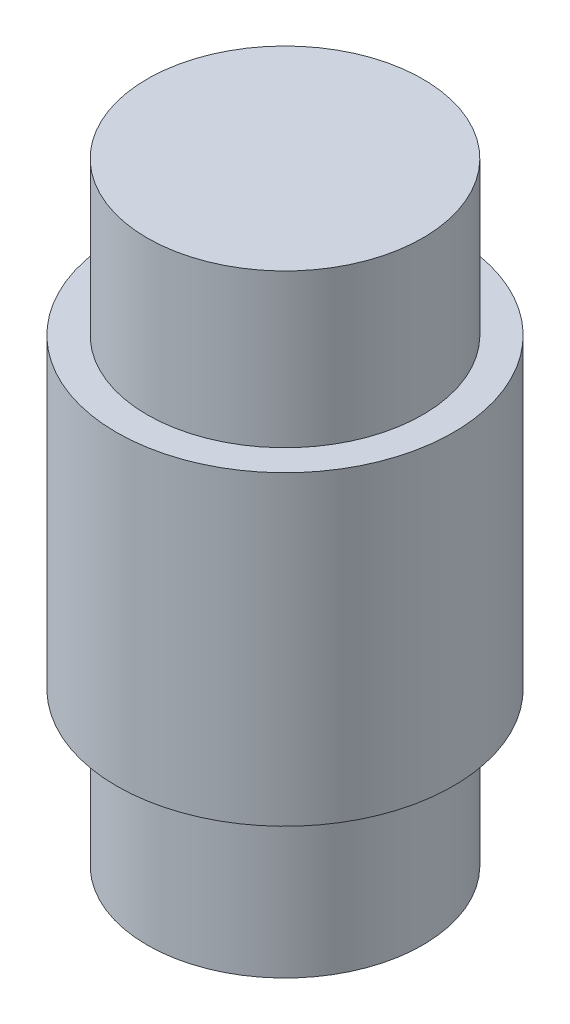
from build123d import *

# Parameters (mm, degrees)
SKETCH1_R           = 5.715
BOSS_EXTRUDE1_DEPTH = 6.35
SKETCH2_R           = 6.985
BOSS_EXTRUDE2_DEPTH = 12.7
SKETCH3_R           = 5.715
BOSS_EXTRUDE3_DEPTH = 6.35


with BuildPart() as part:
    # Sketch1 → Boss-Extrude1 (new body)
    with BuildSketch(Plane(origin=(0, 0, 0), x_dir=(1, 0, 0), z_dir=(0, 1, 0))):
        with Locations(Location((0, 0, 0), (0, 0, 270))):
            Circle(SKETCH1_R)
    extrude(amount=BOSS_EXTRUDE1_DEPTH)

    # Sketch2 → Boss-Extrude2 (add)
    with BuildSketch(Plane(origin=(0, 6.35, 0), x_dir=(1, 0, 0), z_dir=(0, 1, 0))):
        with Locations(Location((0, 0, 0), (0, 0, 270))):
            Circle(SKETCH2_R)
    extrude(amount=BOSS_EXTRUDE2_DEPTH)

    # Sketch3 → Boss-Extrude3 (add)
    with BuildSketch(Plane(origin=(0, 19.05, 0), x_dir=(1, 0, 0), z_dir=(0, 1, 0))):
        with Locations(Location((0, 0, 0), (0, 0, 270))):
            Circle(SKETCH3_R)
    extrude(amount=BOSS_EXTRUDE3_DEPTH)


solid = part.part
